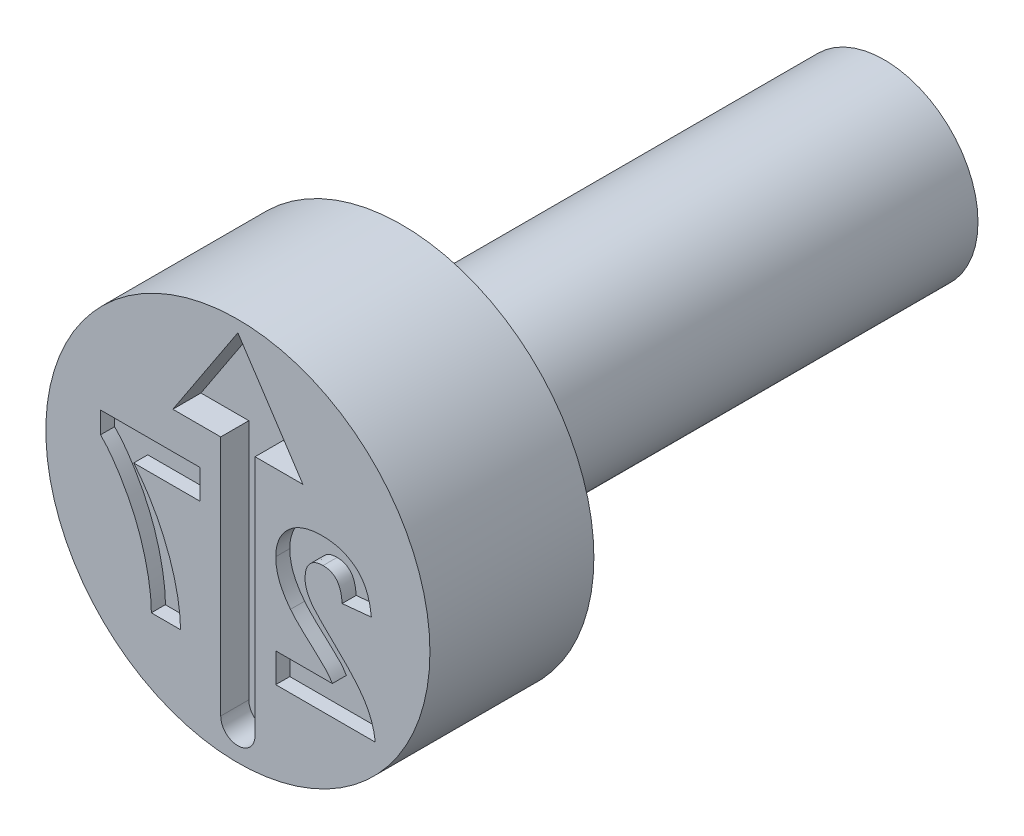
from build123d import *

# Parameters (mm, degrees)
CUT_EXTRUDE4_DEPTH = 0.6
CUT_EXTRUDE5_DEPTH = 0.3


with BuildPart() as part:
    # Sketch2 → Revolve1 (revolve)
    with BuildSketch(Plane(origin=(0, 0, 0), x_dir=(0, 0, -1), z_dir=(1, 0, 0)), mode=Mode.PRIVATE) as revolve1_sk:
        Polygon((0, 4.1), (0, 0), (13.8, 0), (13.8, 2), (3.5, 2), (3.5, 4.1), align=None)
    revolve(revolve1_sk.sketch.rotate(Axis((0, 0, -0.403888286), (0, 0, -1)), 90), axis=Axis((0, 0, -0.403888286), (0, 0, -1)))

    # Sketch3 → Cut-Extrude4 (cut)
    with BuildSketch(Plane.XY):
        with BuildLine():
            Line((0.366422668, 1.743593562), (0.366422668, -3.416891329))
            ThreePointArc((0.366422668, -3.416891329), (0, -3.783313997), (-0.366422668, -3.416891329))
            Line((-0.366422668, -3.416891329), (-0.366422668, 1.743593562))
            Line((-0.366422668, 1.743593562), (-1.388789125, 1.743593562))
            Line((-1.388789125, 1.743593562), (0, 3.851569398))
            Line((0, 3.851569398), (1.388789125, 1.743593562))
            Line((1.388789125, 1.743593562), (0.366422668, 1.743593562))
        make_face()
    extrude(amount=-CUT_EXTRUDE4_DEPTH, mode=Mode.SUBTRACT)

    # Sketch4 → Cut-Extrude5 (cut)
    with BuildSketch(Plane.XY):
        with BuildLine():
            Line((0.808333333, -1.625), (0.808333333, -2.25))
            Line((0.808333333, -2.25), (2.933333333, -2.25))
            add(Edge.make_bspline(
                [(2.933333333, -2.25), (2.926138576, -2.196584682), (2.911753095, -2.089783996), (2.86727833, -1.933775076), (2.807919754, -1.781537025), (2.743497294, -1.657652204), (2.679422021, -1.557929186), (2.621286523, -1.476215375), (2.551933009, -1.389275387), (2.472367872, -1.296407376), (2.383030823, -1.197321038), (2.283255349, -1.092384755), (2.172565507, -0.982100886), (2.094693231, -0.907212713), (2.054427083, -0.868489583)],
                knots=[0, 0, 0, 0, 1.156289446, 2.311930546, 3.473459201, 4.661751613, 5.303057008, 6.018253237, 6.81459331, 7.690699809, 8.644447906, 9.679642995, 10.800191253, 12, 12, 12, 12], degree=3))
            add(Edge.make_bspline(
                [(2.054427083, -0.868489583), (2.022294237, -0.837472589), (1.961122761, -0.778425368), (1.874014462, -0.693872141), (1.79743729, -0.616143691), (1.729790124, -0.547254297), (1.672635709, -0.48544986), (1.625222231, -0.431701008), (1.586949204, -0.385788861), (1.5662205, -0.356662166), (1.55703125, -0.34375)],
                knots=[0, 0, 0, 0, 1.480720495, 2.818855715, 4.024636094, 5.098235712, 6.019786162, 6.815086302, 7.474715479, 8, 8, 8, 8], degree=3))
            add(Edge.make_bspline(
                [(1.55703125, -0.34375), (1.53821391, -0.312492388), (1.501917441, -0.252200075), (1.462115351, -0.157389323), (1.438224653, -0.062598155), (1.434946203, 0.000740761), (1.433333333, 0.031901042)],
                knots=[0, 0, 0, 0, 1.0911822, 2.104764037, 3.067617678, 4, 4, 4, 4], degree=3))
            add(Edge.make_bspline(
                [(1.433333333, 0.031901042), (1.434503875, 0.064327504), (1.436718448, 0.12567584), (1.455288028, 0.212249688), (1.488218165, 0.286672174), (1.533556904, 0.349171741), (1.59088783, 0.398139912), (1.657909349, 0.434322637), (1.73560255, 0.454326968), (1.790209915, 0.456958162), (1.81875, 0.458333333)],
                knots=[0, 0, 0, 0, 1.193122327, 2.257294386, 3.237245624, 4.168877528, 5.075331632, 5.990371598, 6.949684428, 8, 8, 8, 8], degree=3))
            add(Edge.make_bspline(
                [(1.81875, 0.458333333), (1.847097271, 0.457049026), (1.901858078, 0.454568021), (1.979685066, 0.432894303), (2.047769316, 0.395374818), (2.096289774, 0.352617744), (2.129067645, 0.311039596), (2.151401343, 0.274806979), (2.170651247, 0.233635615), (2.187708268, 0.187989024), (2.201181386, 0.137344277), (2.212031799, 0.082087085), (2.220775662, 0.021920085), (2.223556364, -0.019936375), (2.225, -0.041666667)],
                knots=[0, 0, 0, 0, 1.402788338, 2.709884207, 3.961032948, 5.225417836, 5.883680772, 6.578928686, 7.329201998, 8.132101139, 8.990263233, 9.922304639, 10.921339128, 12, 12, 12, 12], degree=3))
            Line((2.225, -0.041666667), (2.85, 0.01953125))
            add(Edge.make_bspline(
                [(2.85, 0.01953125), (2.844975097, 0.061726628), (2.835232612, 0.143536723), (2.810920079, 0.261044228), (2.780129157, 0.369450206), (2.741391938, 0.468553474), (2.696309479, 0.558984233), (2.6425822, 0.639385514), (2.582087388, 0.710647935), (2.514772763, 0.772733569), (2.441066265, 0.825839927), (2.363724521, 0.8732455), (2.281236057, 0.91213314), (2.194509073, 0.944182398), (2.103582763, 0.969795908), (2.008036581, 0.986731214), (1.908460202, 0.998643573), (1.84048895, 0.999541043), (1.805729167, 1)],
                knots=[0, 0, 0, 0, 1.270971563, 2.464210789, 3.586263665, 4.638946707, 5.643716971, 6.603612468, 7.52484387, 8.434700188, 9.336036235, 10.239171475, 11.145359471, 12.059630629, 13.003312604, 13.96741569, 14.960557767, 16, 16, 16, 16], degree=3))
            add(Edge.make_bspline(
                [(1.805729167, 1), (1.767940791, 0.999273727), (1.694343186, 0.997859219), (1.586903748, 0.986178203), (1.485972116, 0.965810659), (1.390665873, 0.938830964), (1.301963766, 0.902811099), (1.219126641, 0.859264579), (1.14345821, 0.806538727), (1.073830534, 0.747508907), (1.011588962, 0.682595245), (0.957070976, 0.61335385), (0.911395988, 0.539832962), (0.873067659, 0.462928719), (0.844609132, 0.381403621), (0.823873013, 0.296384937), (0.810124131, 0.207476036), (0.808936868, 0.146753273), (0.808333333, 0.115885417)],
                knots=[0, 0, 0, 0, 1.210756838, 2.35810096, 3.457354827, 4.507168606, 5.527358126, 6.519769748, 7.499700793, 8.476517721, 9.440526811, 10.376769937, 11.295256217, 12.209626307, 13.124630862, 14.055668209, 15.011616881, 16, 16, 16, 16], degree=3))
            add(Edge.make_bspline(
                [(0.808333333, 0.115885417), (0.809128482, 0.080458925), (0.810705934, 0.010178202), (0.82580887, -0.093717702), (0.848883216, -0.195217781), (0.882985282, -0.294570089), (0.926212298, -0.39415786), (0.981932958, -0.494204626), (1.046628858, -0.59772762), (1.097283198, -0.664659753), (1.1234375, -0.69921875)],
                knots=[0, 0, 0, 0, 0.953409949, 1.89141903, 2.821310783, 3.752688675, 4.715703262, 5.740811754, 6.833515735, 8, 8, 8, 8], degree=3))
            add(Edge.make_bspline(
                [(1.1234375, -0.69921875), (1.133322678, -0.711669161), (1.154494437, -0.738335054), (1.190513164, -0.779223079), (1.23225577, -0.823885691), (1.279132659, -0.873158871), (1.332692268, -0.925297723), (1.391007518, -0.982482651), (1.45664445, -1.041788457), (1.524628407, -1.104694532), (1.592907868, -1.165920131), (1.655666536, -1.224070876), (1.71267229, -1.275521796), (1.761270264, -1.323113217), (1.804318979, -1.36359706), (1.840266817, -1.399049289), (1.869786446, -1.428611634), (1.910462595, -1.474691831), (1.962218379, -1.537015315), (1.998630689, -1.596567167), (2.016015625, -1.625)],
                knots=[0, 0, 0, 0, 0.665555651, 1.425465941, 2.280616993, 3.225313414, 4.272635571, 5.410053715, 6.644756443, 7.976022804, 9.288331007, 10.484517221, 11.558462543, 12.503158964, 13.33222979, 14.032602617, 14.617328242, 15.080653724, 16.606167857, 18, 18, 18, 18], degree=3))
            Line((2.016015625, -1.625), (0.808333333, -1.625))
        make_face()
        with BuildLine():
            Line((-0.806666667, 0.333333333), (-0.806666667, 0.958333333))
            Line((-0.806666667, 0.958333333), (-2.931666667, 0.958333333))
            Line((-2.931666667, 0.958333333), (-2.931666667, 0.5))
            add(Edge.make_bspline(
                [(-2.931666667, 0.5), (-2.909498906, 0.477445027), (-2.863928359, 0.431078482), (-2.798653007, 0.35519502), (-2.732410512, 0.272848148), (-2.666586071, 0.182928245), (-2.599133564, 0.086855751), (-2.533017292, -0.017210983), (-2.465960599, -0.127921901), (-2.375681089, -0.284522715), (-2.270155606, -0.489091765), (-2.158515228, -0.743381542), (-2.063402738, -1.005480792), (-1.99827388, -1.228808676), (-1.954268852, -1.40780563), (-1.925518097, -1.538692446), (-1.901316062, -1.665895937), (-1.881627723, -1.789639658), (-1.866933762, -1.909980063), (-1.855323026, -2.026498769), (-1.849594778, -2.13947991), (-1.848749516, -2.213536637), (-1.848333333, -2.25)],
                knots=[0, 0, 0, 0, 0.628545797, 1.29210959, 1.98878689, 2.729126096, 3.507039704, 4.322017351, 5.179550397, 6.080149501, 7.915136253, 9.752312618, 11.597470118, 13.454141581, 14.373891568, 15.261584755, 16.117868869, 16.947726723, 17.752002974, 18.527724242, 19.275094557, 20, 20, 20, 20], degree=3))
            Line((-1.848333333, -2.25), (-1.223333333, -2.25))
            add(Edge.make_bspline(
                [(-1.223333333, -2.25), (-1.225423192, -2.194632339), (-1.229626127, -2.083281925), (-1.245351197, -1.916148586), (-1.270049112, -1.748392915), (-1.300725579, -1.579627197), (-1.341226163, -1.410262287), (-1.387449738, -1.239670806), (-1.443442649, -1.068763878), (-1.5062092, -0.897868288), (-1.575500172, -0.728606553), (-1.651017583, -0.563078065), (-1.732566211, -0.40231552), (-1.819085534, -0.245754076), (-1.911582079, -0.093897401), (-2.010125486, 0.053089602), (-2.113317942, 0.196270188), (-2.18710178, 0.287653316), (-2.223984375, 0.333333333)],
                knots=[0, 0, 0, 0, 0.943249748, 1.896978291, 2.856365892, 3.829648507, 4.816416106, 5.820376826, 6.838120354, 7.877341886, 8.919613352, 9.951365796, 10.974227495, 11.988073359, 12.996274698, 14.000568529, 15.000536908, 16, 16, 16, 16], degree=3))
            Line((-2.223984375, 0.333333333), (-0.806666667, 0.333333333))
        make_face()
    extrude(amount=-CUT_EXTRUDE5_DEPTH, mode=Mode.SUBTRACT)


solid = part.part
